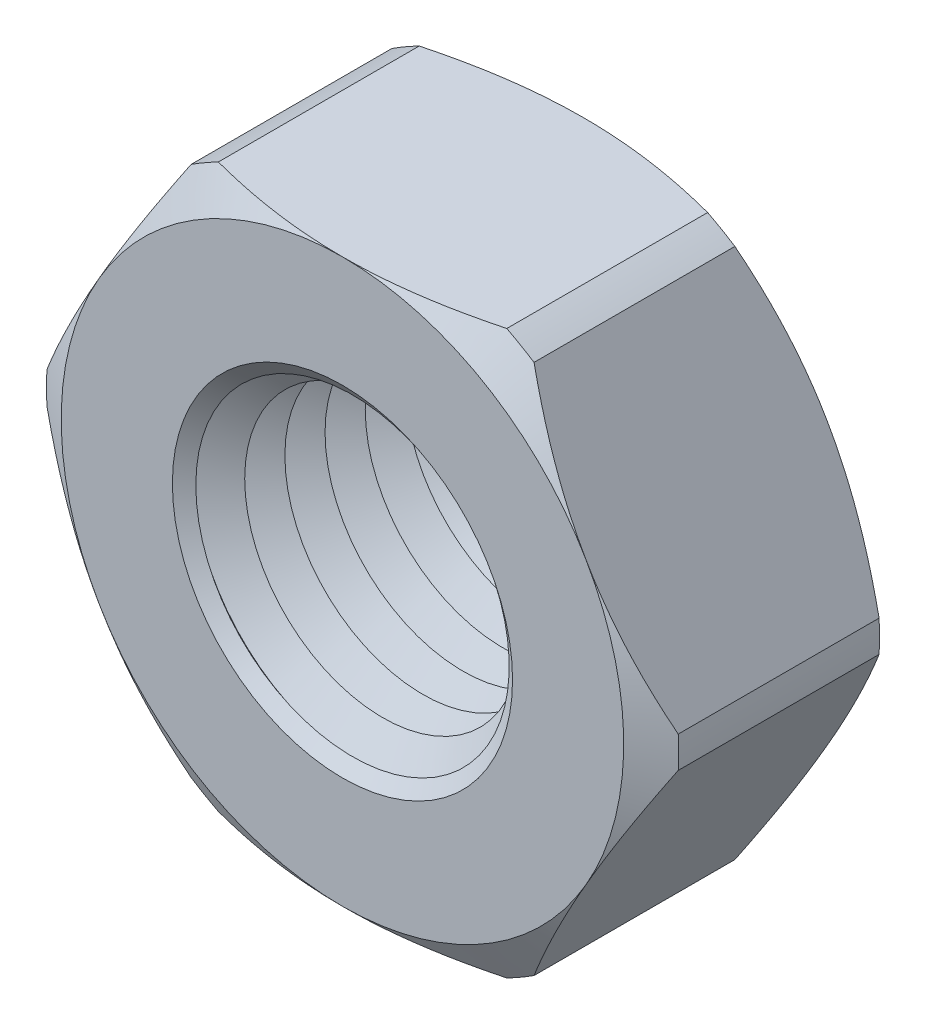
from build123d import *

# Parameters (mm, degrees)
SKETCH_3_OUTSIDE_W  = 32.514
SKETCH_3_OUTSIDE_H  = 32.514
CUT_EXTRUDE_1_DEPTH = 19.959957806


with BuildPart() as part:
    # Sketch 2 → Revolve 1 (revolve)
    with BuildSketch(Plane.XZ, mode=Mode.PRIVATE) as revolve_1_sk:
        Polygon((6.35, 0), (5.85, 0.375), (6.35, 0.75), (5.15, 1.5), (6.35, 2.25), (5.15, 3), (6.35, 3.75), (5.15, 4.5), (6.35, 5.25), (5.15, 6), (6.35, 6.75), (5.15, 7.5), (6.35, 8.25), (5.85, 8.625), (6.35, 9), (10.5, 9), (11.8, 8.24944465), (11.8, 0.75055535), (10.5, 0), align=None)
    revolve(revolve_1_sk.sketch.rotate(Axis((0, 0, 0), (0, 0, 1)), 180), axis=Axis((0, 0, 0), (0, 0, 1)))

    # Sketch 3 outside → Cut-Extrude 1 (cut, through all)
    with BuildSketch(Plane.XY):
        Rectangle(SKETCH_3_OUTSIDE_W, SKETCH_3_OUTSIDE_H)
        Polygon((12.124355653, 0), (6.062177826, 10.5), (-6.062177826, 10.5), (-12.124355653, 0), (-6.062177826, -10.5), (6.062177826, -10.5), align=None, mode=Mode.SUBTRACT)
    extrude(amount=CUT_EXTRUDE_1_DEPTH, mode=Mode.SUBTRACT)


solid = part.part
